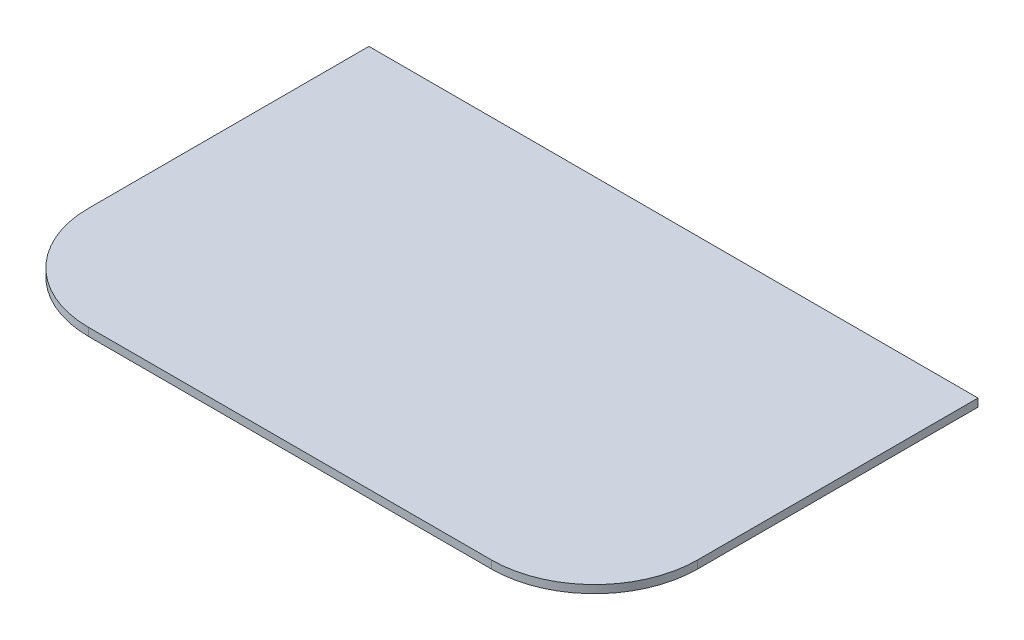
from build123d import *

# Parameters (mm, degrees)
SKETCH1_W      = 195.16722091
SKETCH1_H      = 122.87502451
EXTRUDE1_DEPTH = 2.54
FILLET1_R      = 33.02


with BuildPart() as part:
    # Sketch1 → Extrude1 (new body)
    with BuildSketch(Plane(origin=(0, 0, 0), x_dir=(1, 0, 0), z_dir=(0, 1, 0))):
        Rectangle(SKETCH1_W, SKETCH1_H)
    extrude(amount=EXTRUDE1_DEPTH)

    # Fillet1
    fillet1_edges = [part.edges().sort_by_distance(p)[0] for p in [
        (97.583610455, 1.27, 61.437512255),
        (-97.583610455, 1.27, 61.437512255),
    ]]
    fillet(fillet1_edges, radius=FILLET1_R)


solid = part.part
